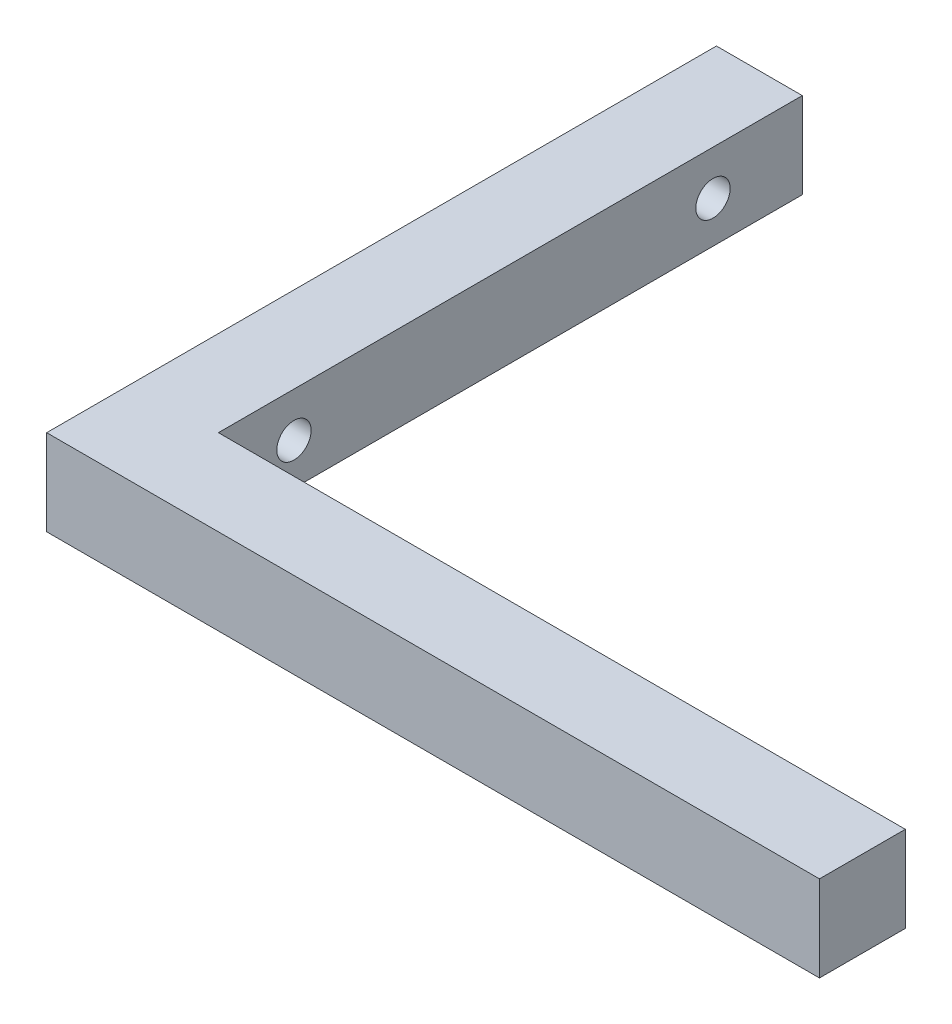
from build123d import *

# Parameters (mm, degrees)
BOSS_EXTRUDE1_DEPTH = 6.35
SKETCH3_R           = 1.27
CUT_EXTRUDE2_DEPTH  = 6.35


with BuildPart() as part:
    # Sketch1 → Boss-Extrude1 (new body)
    with BuildSketch(Plane(origin=(0, 0, 0), x_dir=(1, 0, 0), z_dir=(0, 1, 0))):
        Polygon((0, 0), (-57.15, 0), (-57.15, 49.53), (-50.8, 49.53), (-50.8, 6.35), (0, 6.35), align=None)
    extrude(amount=BOSS_EXTRUDE1_DEPTH)

    # Sketch3 → Cut-Extrude2 (cut)
    with BuildSketch(Plane.ZY.offset(57.15)):
        with Locations((-42.926, 3.072725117)):
            Circle(SKETCH3_R)
        with Locations((-11.938, 3.072725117)):
            Circle(SKETCH3_R)
    extrude(amount=-CUT_EXTRUDE2_DEPTH, mode=Mode.SUBTRACT)


solid = part.part
